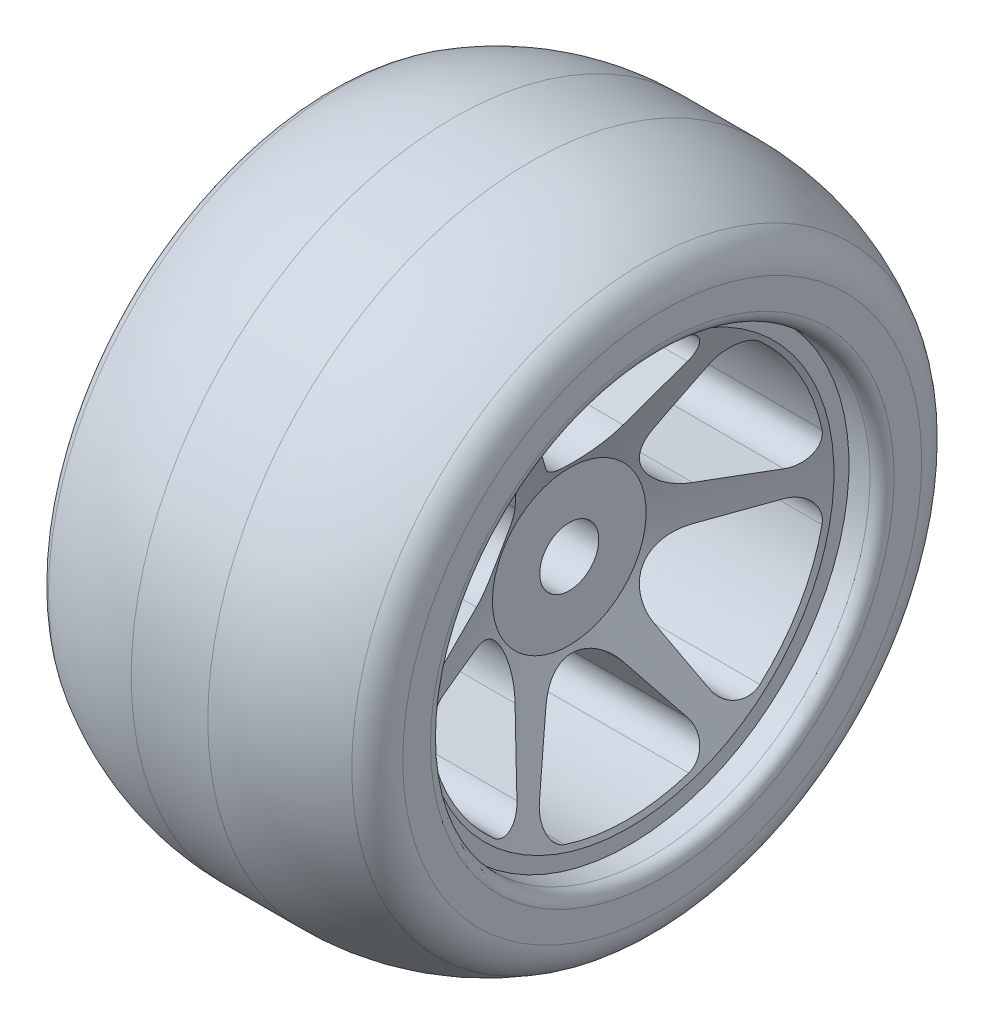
from build123d import *

# Parameters (mm, degrees)
FILLET1_R          = 6.35
FILLET2_R          = 2.032
CUT_EXTRUDE1_START = -12.7
CUT_EXTRUDE1_DEPTH = 63.5
CIRPATTERN1_COUNT  = 6


with BuildPart() as part:
    # Sketch2 → Revolve1 (revolve)
    with BuildSketch(Plane.XY, mode=Mode.PRIVATE) as revolve1_sk:
        Polygon((0, 5), (33.528, 5), (33.528, 13.0175), (43.688, 34.671), (43.688, 37.211), (0, 37.211), align=None)
    revolve(revolve1_sk.sketch.rotate(Axis((0, 0, 0), (1, 0, 0)), 90), axis=Axis((0, 0, 0), (1, 0, 0)))

    # Sketch5 → Cut-Extrude1 (cut)
    with BuildSketch(Plane(origin=(0, 0, 0), x_dir=(0, 0, -1), z_dir=(1, 0, 0)).offset(CUT_EXTRUDE1_START)):
        with BuildLine():
            Line((-12.537007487, 26.098175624), (-6.532014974, 17.356769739))
            ThreePointArc((-6.532014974, 17.356769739), (0, 13.9192), (6.532014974, 17.356769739))
            Line((6.532014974, 17.356769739), (12.537007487, 26.098175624))
            ThreePointArc((12.537007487, 26.098175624), (13.024238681, 29.612150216), (10.502921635, 32.107820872))
            ThreePointArc((10.502921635, 32.107820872), (0, 33.782), (-10.502921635, 32.107820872))
            ThreePointArc((-10.502921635, 32.107820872), (-13.024238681, 29.612150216), (-12.537007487, 26.098175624))
        make_face()
    cut_extrude1 = extrude(amount=CUT_EXTRUDE1_DEPTH, mode=Mode.SUBTRACT)

    # CirPattern1: Cut-Extrude1 ×6 about axis
    cirpattern1_axis = Axis((0, 0, 0), (1, 0, 0))
    for i in range(1, CIRPATTERN1_COUNT):
        add(cut_extrude1.rotate(cirpattern1_axis, i * 360 / CIRPATTERN1_COUNT), mode=Mode.SUBTRACT)


with BuildPart() as body_2:
    # Sketch4 → Revolve2 (revolve)
    with BuildSketch(Plane.XY, mode=Mode.PRIVATE) as revolve2_sk:
        with BuildLine():
            Line((43.688, 37.211), (0, 37.211))
            Line((0, 37.211), (-8.382, 37.211))
            Line((-8.382, 37.211), (-8.382, 47.371))
            ThreePointArc((-8.382, 47.371), (2.217769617, 52.75509691), (13.960978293, 54.61))
            Line((13.960978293, 54.61), (26.933021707, 54.61))
            ThreePointArc((26.933021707, 54.61), (38.676230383, 52.75509691), (49.276, 47.371))
            Line((49.276, 47.371), (49.276, 37.211))
            Line((49.276, 37.211), (43.688, 37.211))
        make_face()
    revolve(revolve2_sk.sketch.rotate(Axis((0, 0, 0), (1, 0, 0)), 90), axis=Axis((0, 0, 0), (1, 0, 0)))

    # Fillet1
    fillet1_edges = [body_2.edges().sort_by_distance(p)[0] for p in [
        (-8.382, 0, -47.371),
        (49.276, 0, -47.371),
    ]]
    fillet(fillet1_edges, radius=FILLET1_R)

    # Fillet2
    fillet2_edges = [body_2.edges().sort_by_distance(p)[0] for p in [
        (-8.382, 0, -37.211),
        (49.276, 0, -37.211),
    ]]
    fillet(fillet2_edges, radius=FILLET2_R)


solid = Compound([part.part, body_2.part])
